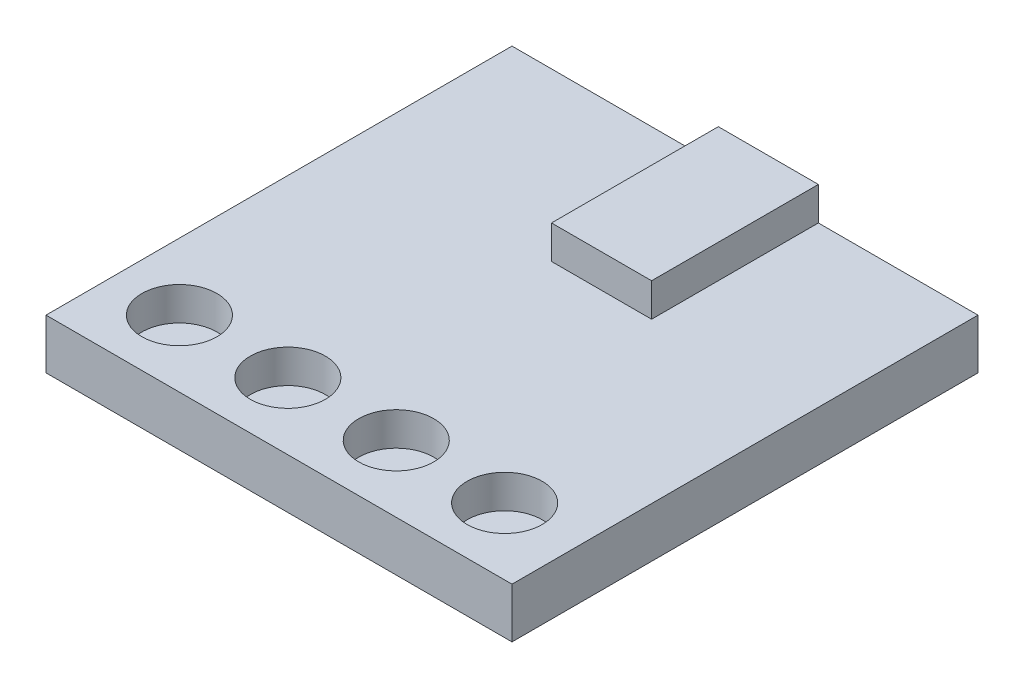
from build123d import *

# Parameters (mm, degrees)
SKETCH1_W           = 13.97
SKETCH1_H           = 13.97
BOSS_EXTRUDE1_DEPTH = 1.5
SKETCH2_R           = 1.125
CUT_EXTRUDE1_DEPTH  = 1
SKETCH3_W           = 3
SKETCH3_H           = 5
BOSS_EXTRUDE2_DEPTH = 1


with BuildPart() as part:
    # Sketch1 → Boss-Extrude1 (new body)
    with BuildSketch(Plane(origin=(0, 0, 0), x_dir=(1, 0, 0), z_dir=(0, 1, 0))):
        with Locations((6.985, 6.985)):
            Rectangle(SKETCH1_W, SKETCH1_H)
    extrude(amount=BOSS_EXTRUDE1_DEPTH)

    # Sketch2 → Cut-Extrude1 (cut)
    with BuildSketch(Plane(origin=(0, 1.5, 0), x_dir=(1, 0, 0), z_dir=(0, 1, 0))):
        with Locations(Location((2, 2, 0), (0, 0, 270))):
            Circle(SKETCH2_R)
        with Locations(Location((5.25, 2, 0), (0, 0, 270))):
            Circle(SKETCH2_R)
        with Locations(Location((8.5, 2, 0), (0, 0, 270))):
            Circle(SKETCH2_R)
        with Locations(Location((11.75, 2, 0), (0, 0, 270))):
            Circle(SKETCH2_R)
    extrude(amount=-CUT_EXTRUDE1_DEPTH, mode=Mode.SUBTRACT)

    # Sketch3 → Boss-Extrude2 (add)
    with BuildSketch(Plane(origin=(0, 1.5, 0), x_dir=(1, 0, 0), z_dir=(0, 1, 0))):
        with Locations((7.684655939, 11.47)):
            Rectangle(SKETCH3_W, SKETCH3_H)
    extrude(amount=BOSS_EXTRUDE2_DEPTH)


solid = part.part
